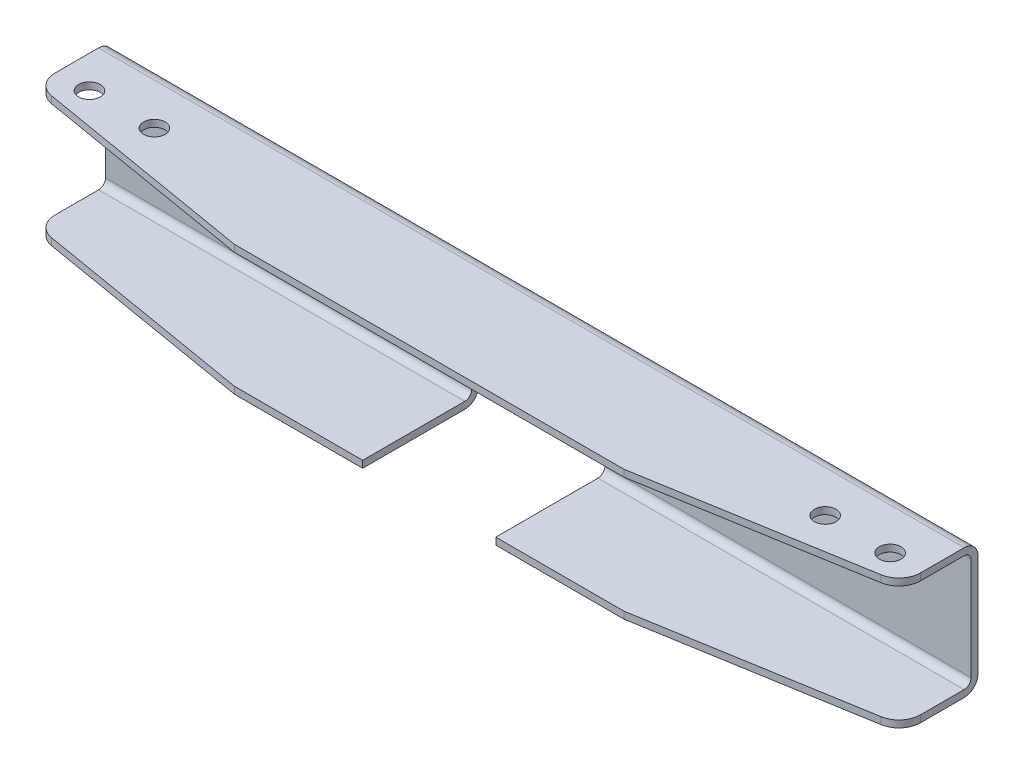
from build123d import *

# Parameters (mm, degrees)
EL_MENT_M_CANO_SOUD_1_DEPTH = 400
ESQUISSE10_W                = 400
ESQUISSE10_H                = 60
EXTRUSION3_DEPTH            = 6.4
EXTRUSION4_REACH            = 407.586
EXTRUSION5_START            = -3.2
ESQUISSE12_W                = 61.5
ESQUISSE12_H                = 56.8
EXTRUSION5_DEPTH            = 53.6
EXTRUSION6_REACH            = 407.586
ESQUISSE13_R                = 5
CONG_2_R                    = 10


with BuildPart() as part:
    # Sketch16 → El_ment m_cano-soud_1 (new body)
    with BuildSketch(Plane.YZ):
        with BuildLine():
            Line((-23.6, -30), (23.6, -30))
            ThreePointArc((23.6, -30), (28.1254834, -28.1254834), (30, -23.6))
            Line((30, -23.6), (30, 23.6))
            ThreePointArc((30, 23.6), (28.1254834, 28.1254834), (23.6, 30))
            Line((23.6, 30), (-23.6, 30))
            ThreePointArc((-23.6, 30), (-28.1254834, 28.1254834), (-30, 23.6))
            Line((-30, 23.6), (-30, -23.6))
            ThreePointArc((-30, -23.6), (-28.1254834, -28.1254834), (-23.6, -30))
        make_face()
        with BuildLine():
            Line((-23.6, -26.8), (23.6, -26.8))
            ThreePointArc((23.6, -26.8), (25.8627417, -25.8627417), (26.8, -23.6))
            Line((26.8, -23.6), (26.8, 23.6))
            ThreePointArc((26.8, 23.6), (25.8627417, 25.8627417), (23.6, 26.8))
            Line((23.6, 26.8), (-23.6, 26.8))
            ThreePointArc((-23.6, 26.8), (-25.8627417, 25.8627417), (-26.8, 23.6))
            Line((-26.8, 23.6), (-26.8, -23.6))
            ThreePointArc((-26.8, -23.6), (-25.8627417, -25.8627417), (-23.6, -26.8))
        make_face(mode=Mode.SUBTRACT)
    extrude(amount=EL_MENT_M_CANO_SOUD_1_DEPTH)

    # Esquisse10 → Extrusion3 (cut)
    with BuildSketch(Plane.XY.offset(30)):
        with Locations((200, 0)):
            Rectangle(ESQUISSE10_W, ESQUISSE10_H)
    extrude(amount=-EXTRUSION3_DEPTH, mode=Mode.SUBTRACT)

    # Esquisse11 → Extrusion4 (cut, up to next)
    with BuildSketch(Plane(origin=(0, 30, 0), x_dir=(1, 0, 0), z_dir=(0, 1, 0)), mode=Mode.PRIVATE) as extrusion4_sk1:
        Polygon((0, -5), (110, -23.6), (0, -23.6), align=None)
    extrusion4_tool1 = extrude(extrusion4_sk1.sketch, amount=-EXTRUSION4_REACH, mode=Mode.PRIVATE) & part.part
    # Esquisse11 → Extrusion4 (cut, up to next)
    with BuildSketch(Plane(origin=(0, 30, 0), x_dir=(1, 0, 0), z_dir=(0, 1, 0)), mode=Mode.PRIVATE) as extrusion4_sk2:
        Polygon((290, -23.6), (400, -5), (400, -23.6), align=None)
    extrusion4_tool2 = extrude(extrusion4_sk2.sketch, amount=-EXTRUSION4_REACH, mode=Mode.PRIVATE) & part.part
    extrusion4_1 = extrusion4_tool1.solids().sort_by_distance((36.666667, 30, 17.4))[0]
    add(extrusion4_1, mode=Mode.SUBTRACT)
    extrusion4_2 = extrusion4_tool2.solids().sort_by_distance((363.333333, 30, 17.4))[0]
    add(extrusion4_2, mode=Mode.SUBTRACT)
    extrusion4 = extrusion4_1 + extrusion4_2  # Extrusion4 as one shape, for the pattern or mirror that repeats it

    # Sym_trie1: Extrusion4 across plane
    add(extrusion4.mirror(Plane(origin=(0, 0, 0), x_dir=(0, 0, 1), z_dir=(0, -1, 0))), mode=Mode.SUBTRACT)

    # Esquisse12 → Extrusion5 (cut)
    with BuildSketch(Plane.XY.offset(-26.8).offset(EXTRUSION5_START)):
        with Locations((200, -1.6)):
            Rectangle(ESQUISSE12_W, ESQUISSE12_H)
    extrude(amount=EXTRUSION5_DEPTH, mode=Mode.SUBTRACT)

    # Esquisse13 → Extrusion6 (cut, up to next)
    with BuildSketch(Plane(origin=(0, 30, 0), x_dir=(-1, 0, 0), z_dir=(0, 1, 0)), mode=Mode.PRIVATE) as extrusion6_sk1:
        with Locations(Location((-15, -4.4, 0), (0, 0, 90))):
            Circle(ESQUISSE13_R)
    extrusion6_tool1 = extrude(extrusion6_sk1.sketch, amount=-EXTRUSION6_REACH, mode=Mode.PRIVATE) & part.part
    # Esquisse13 → Extrusion6 (cut, up to next)
    with BuildSketch(Plane(origin=(0, 30, 0), x_dir=(-1, 0, 0), z_dir=(0, 1, 0)), mode=Mode.PRIVATE) as extrusion6_sk2:
        with Locations(Location((-45, -4.4, 0), (0, 0, 90))):
            Circle(ESQUISSE13_R)
    extrusion6_tool2 = extrude(extrusion6_sk2.sketch, amount=-EXTRUSION6_REACH, mode=Mode.PRIVATE) & part.part
    # Esquisse13 → Extrusion6 (cut, up to next)
    with BuildSketch(Plane(origin=(0, 30, 0), x_dir=(-1, 0, 0), z_dir=(0, 1, 0)), mode=Mode.PRIVATE) as extrusion6_sk3:
        with Locations(Location((-355, -4.4, 0), (0, 0, 90))):
            Circle(ESQUISSE13_R)
    extrusion6_tool3 = extrude(extrusion6_sk3.sketch, amount=-EXTRUSION6_REACH, mode=Mode.PRIVATE) & part.part
    # Esquisse13 → Extrusion6 (cut, up to next)
    with BuildSketch(Plane(origin=(0, 30, 0), x_dir=(-1, 0, 0), z_dir=(0, 1, 0)), mode=Mode.PRIVATE) as extrusion6_sk4:
        with Locations(Location((-385, -4.4, 0), (0, 0, 90))):
            Circle(ESQUISSE13_R)
    extrusion6_tool4 = extrude(extrusion6_sk4.sketch, amount=-EXTRUSION6_REACH, mode=Mode.PRIVATE) & part.part
    add(extrusion6_tool1.solids().sort_by_distance((15, 30, -4.4))[0], mode=Mode.SUBTRACT)
    add(extrusion6_tool2.solids().sort_by_distance((45, 30, -4.4))[0], mode=Mode.SUBTRACT)
    add(extrusion6_tool3.solids().sort_by_distance((355, 30, -4.4))[0], mode=Mode.SUBTRACT)
    add(extrusion6_tool4.solids().sort_by_distance((385, 30, -4.4))[0], mode=Mode.SUBTRACT)

    # Cong_2
    cong_2_edges = [part.edges().sort_by_distance(p)[0] for p in [
        (400, -28.4, 5),
        (0, 28.4, 5),
        (400, 28.4, 5),
        (0, -28.4, 5),
    ]]
    fillet(cong_2_edges, radius=CONG_2_R)


solid = part.part
